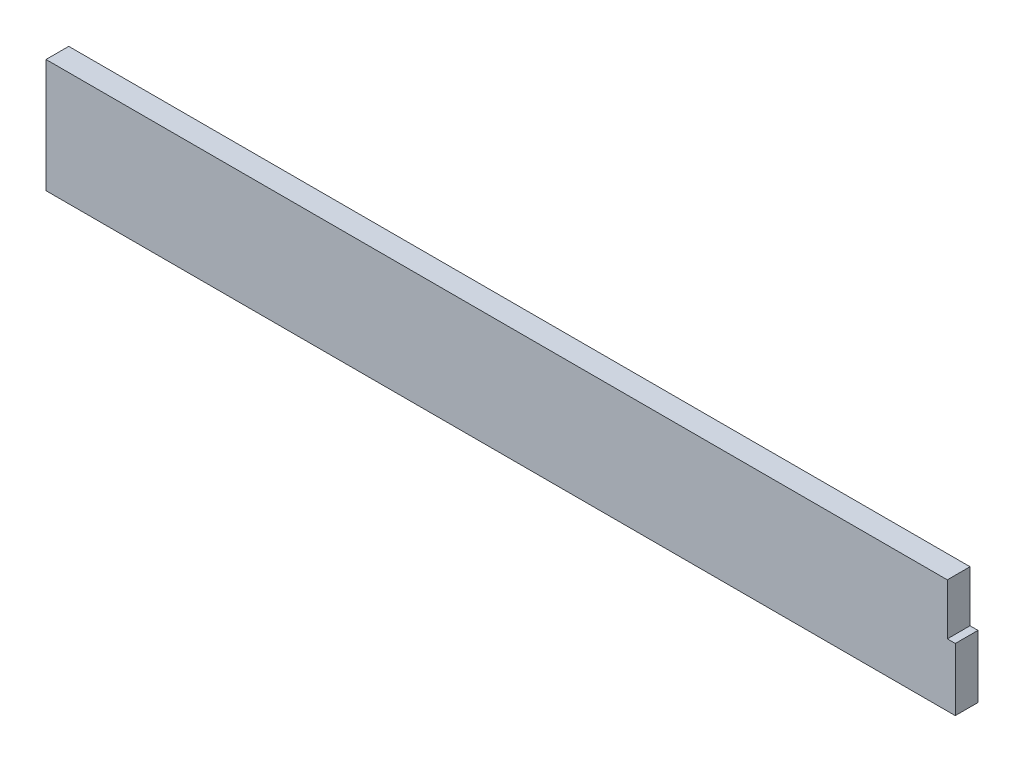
ISO-10303-21;
HEADER;
FILE_DESCRIPTION(('STEP AP214'),'2;1');
FILE_NAME('part.step','',(''),(''),'','','');
FILE_SCHEMA(('AUTOMOTIVE_DESIGN { 1 0 10303 214 1 1 1 1 }'));
ENDSEC;
DATA;
#1=APPLICATION_CONTEXT('core data for automotive mechanical design processes');
#2=APPLICATION_PROTOCOL_DEFINITION('international standard','automotive_design',2000,#1);
#3=PRODUCT_CONTEXT('',#1,'mechanical');
#4=PRODUCT('Part','Part','',(#3));
#5=PRODUCT_RELATED_PRODUCT_CATEGORY('part','',(#4));
#6=PRODUCT_DEFINITION_FORMATION('','',#4);
#7=PRODUCT_DEFINITION_CONTEXT('part definition',#1,'design');
#8=PRODUCT_DEFINITION('design','',#6,#7);
#9=PRODUCT_DEFINITION_SHAPE('','',#8);
#10=(LENGTH_UNIT() NAMED_UNIT(*) SI_UNIT(.MILLI.,.METRE.));
#11=(NAMED_UNIT(*) PLANE_ANGLE_UNIT() SI_UNIT($,.RADIAN.));
#12=(NAMED_UNIT(*) SI_UNIT($,.STERADIAN.) SOLID_ANGLE_UNIT());
#13=UNCERTAINTY_MEASURE_WITH_UNIT(LENGTH_MEASURE(1.E-05),#10,'distance_accuracy_value','');
#14=(GEOMETRIC_REPRESENTATION_CONTEXT(3) GLOBAL_UNCERTAINTY_ASSIGNED_CONTEXT((#13)) GLOBAL_UNIT_ASSIGNED_CONTEXT((#10,
#11,#12)) REPRESENTATION_CONTEXT('',''));
#15=CARTESIAN_POINT('',(0.,0.,0.));
#16=DIRECTION('',(0.,0.,1.));
#17=DIRECTION('',(1.,0.,0.));
#18=AXIS2_PLACEMENT_3D('',#15,#16,#17);
#19=CARTESIAN_POINT('',(0.,0.,2.));
#20=DIRECTION('',(1.,0.,0.));
#21=DIRECTION('',(0.,0.,-1.));
#22=AXIS2_PLACEMENT_3D('',#19,#20,#21);
#23=PLANE('',#22);
#24=DIRECTION('',(0.,-1.,0.));
#25=VECTOR('',#24,1.);
#26=CARTESIAN_POINT('',(0.,0.,0.));
#27=LINE('',#26,#25);
#28=CARTESIAN_POINT('',(0.,10.,0.));
#29=VERTEX_POINT('',#28);
#30=CARTESIAN_POINT('',(0.,0.,0.));
#31=VERTEX_POINT('',#30);
#32=EDGE_CURVE('E116',#29,#31,#27,.T.);
#33=ORIENTED_EDGE('',*,*,#32,.T.);
#34=DIRECTION('',(0.,0.,-1.));
#35=VECTOR('',#34,1.);
#36=CARTESIAN_POINT('',(0.,0.,2.));
#37=LINE('',#36,#35);
#38=CARTESIAN_POINT('',(0.,0.,2.));
#39=VERTEX_POINT('',#38);
#40=EDGE_CURVE('E11',#39,#31,#37,.T.);
#41=ORIENTED_EDGE('',*,*,#40,.F.);
#42=DIRECTION('',(0.,-1.,0.));
#43=VECTOR('',#42,1.);
#44=CARTESIAN_POINT('',(0.,0.,2.));
#45=LINE('',#44,#43);
#46=CARTESIAN_POINT('',(0.,10.,2.));
#47=VERTEX_POINT('',#46);
#48=EDGE_CURVE('E126',#47,#39,#45,.T.);
#49=ORIENTED_EDGE('',*,*,#48,.F.);
#50=DIRECTION('',(0.,0.,-1.));
#51=VECTOR('',#50,1.);
#52=CARTESIAN_POINT('',(0.,10.,2.));
#53=LINE('',#52,#51);
#54=EDGE_CURVE('E112',#47,#29,#53,.T.);
#55=ORIENTED_EDGE('',*,*,#54,.T.);
#56=EDGE_LOOP('',(#33,#41,#49,#55));
#57=FACE_BOUND('',#56,.T.);
#58=ADVANCED_FACE('F32',(#57),#23,.F.);
#59=CARTESIAN_POINT('',(0.,0.,2.));
#60=DIRECTION('',(0.,1.,0.));
#61=DIRECTION('',(0.,0.,1.));
#62=AXIS2_PLACEMENT_3D('',#59,#60,#61);
#63=PLANE('',#62);
#64=DIRECTION('',(1.,0.,0.));
#65=VECTOR('',#64,1.);
#66=CARTESIAN_POINT('',(0.,0.,0.));
#67=LINE('',#66,#65);
#68=CARTESIAN_POINT('',(80.,0.,0.));
#69=VERTEX_POINT('',#68);
#70=EDGE_CURVE('E119',#31,#69,#67,.T.);
#71=ORIENTED_EDGE('',*,*,#70,.T.);
#72=DIRECTION('',(0.,0.,-1.));
#73=VECTOR('',#72,1.);
#74=CARTESIAN_POINT('',(80.,0.,2.));
#75=LINE('',#74,#73);
#76=CARTESIAN_POINT('',(80.,0.,2.));
#77=VERTEX_POINT('',#76);
#78=EDGE_CURVE('E40',#77,#69,#75,.T.);
#79=ORIENTED_EDGE('',*,*,#78,.F.);
#80=DIRECTION('',(1.,0.,0.));
#81=VECTOR('',#80,1.);
#82=CARTESIAN_POINT('',(0.,0.,2.));
#83=LINE('',#82,#81);
#84=EDGE_CURVE('E85',#39,#77,#83,.T.);
#85=ORIENTED_EDGE('',*,*,#84,.F.);
#86=ORIENTED_EDGE('',*,*,#40,.T.);
#87=EDGE_LOOP('',(#71,#79,#85,#86));
#88=FACE_BOUND('',#87,.T.);
#89=ADVANCED_FACE('F150',(#88),#63,.F.);
#90=CARTESIAN_POINT('',(80.,0.,2.));
#91=DIRECTION('',(-1.,0.,0.));
#92=DIRECTION('',(0.,0.,1.));
#93=AXIS2_PLACEMENT_3D('',#90,#91,#92);
#94=PLANE('',#93);
#95=DIRECTION('',(0.,1.,0.));
#96=VECTOR('',#95,1.);
#97=CARTESIAN_POINT('',(80.,0.,0.));
#98=LINE('',#97,#96);
#99=CARTESIAN_POINT('',(80.,5.5,0.));
#100=VERTEX_POINT('',#99);
#101=EDGE_CURVE('E121',#69,#100,#98,.T.);
#102=ORIENTED_EDGE('',*,*,#101,.T.);
#103=DIRECTION('',(0.,0.,-1.));
#104=VECTOR('',#103,1.);
#105=CARTESIAN_POINT('',(80.,5.5,2.));
#106=LINE('',#105,#104);
#107=CARTESIAN_POINT('',(80.,5.5,2.));
#108=VERTEX_POINT('',#107);
#109=EDGE_CURVE('E107',#108,#100,#106,.T.);
#110=ORIENTED_EDGE('',*,*,#109,.F.);
#111=DIRECTION('',(0.,1.,0.));
#112=VECTOR('',#111,1.);
#113=CARTESIAN_POINT('',(80.,0.,2.));
#114=LINE('',#113,#112);
#115=EDGE_CURVE('E98',#77,#108,#114,.T.);
#116=ORIENTED_EDGE('',*,*,#115,.F.);
#117=ORIENTED_EDGE('',*,*,#78,.T.);
#118=EDGE_LOOP('',(#102,#110,#116,#117));
#119=FACE_BOUND('',#118,.T.);
#120=ADVANCED_FACE('F132',(#119),#94,.F.);
#121=CARTESIAN_POINT('',(79.3000000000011,5.5,2.));
#122=DIRECTION('',(0.,-1.,0.));
#123=DIRECTION('',(0.,0.,-1.));
#124=AXIS2_PLACEMENT_3D('',#121,#122,#123);
#125=PLANE('',#124);
#126=DIRECTION('',(-1.,0.,0.));
#127=VECTOR('',#126,1.);
#128=CARTESIAN_POINT('',(79.3000000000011,5.5,0.));
#129=LINE('',#128,#127);
#130=CARTESIAN_POINT('',(79.3000000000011,5.5,0.));
#131=VERTEX_POINT('',#130);
#132=EDGE_CURVE('E106',#100,#131,#129,.T.);
#133=ORIENTED_EDGE('',*,*,#132,.T.);
#134=DIRECTION('',(0.,0.,-1.));
#135=VECTOR('',#134,1.);
#136=CARTESIAN_POINT('',(79.3000000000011,5.5,2.));
#137=LINE('',#136,#135);
#138=CARTESIAN_POINT('',(79.3000000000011,5.5,2.));
#139=VERTEX_POINT('',#138);
#140=EDGE_CURVE('E103',#139,#131,#137,.T.);
#141=ORIENTED_EDGE('',*,*,#140,.F.);
#142=DIRECTION('',(-1.,0.,0.));
#143=VECTOR('',#142,1.);
#144=CARTESIAN_POINT('',(79.3000000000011,5.5,2.));
#145=LINE('',#144,#143);
#146=EDGE_CURVE('E92',#108,#139,#145,.T.);
#147=ORIENTED_EDGE('',*,*,#146,.F.);
#148=ORIENTED_EDGE('',*,*,#109,.T.);
#149=EDGE_LOOP('',(#133,#141,#147,#148));
#150=FACE_BOUND('',#149,.T.);
#151=ADVANCED_FACE('F104',(#150),#125,.F.);
#152=CARTESIAN_POINT('',(79.3000000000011,5.5,2.));
#153=DIRECTION('',(-1.,0.,0.));
#154=DIRECTION('',(0.,0.,1.));
#155=AXIS2_PLACEMENT_3D('',#152,#153,#154);
#156=PLANE('',#155);
#157=DIRECTION('',(0.,1.,0.));
#158=VECTOR('',#157,1.);
#159=CARTESIAN_POINT('',(79.3000000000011,5.5,0.));
#160=LINE('',#159,#158);
#161=CARTESIAN_POINT('',(79.3000000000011,10.,0.));
#162=VERTEX_POINT('',#161);
#163=EDGE_CURVE('E71',#131,#162,#160,.T.);
#164=ORIENTED_EDGE('',*,*,#163,.T.);
#165=DIRECTION('',(0.,0.,-1.));
#166=VECTOR('',#165,1.);
#167=CARTESIAN_POINT('',(79.3000000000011,10.,2.));
#168=LINE('',#167,#166);
#169=CARTESIAN_POINT('',(79.3000000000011,10.,2.));
#170=VERTEX_POINT('',#169);
#171=EDGE_CURVE('E108',#170,#162,#168,.T.);
#172=ORIENTED_EDGE('',*,*,#171,.F.);
#173=DIRECTION('',(0.,1.,0.));
#174=VECTOR('',#173,1.);
#175=CARTESIAN_POINT('',(79.3000000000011,5.5,2.));
#176=LINE('',#175,#174);
#177=EDGE_CURVE('E96',#139,#170,#176,.T.);
#178=ORIENTED_EDGE('',*,*,#177,.F.);
#179=ORIENTED_EDGE('',*,*,#140,.T.);
#180=EDGE_LOOP('',(#164,#172,#178,#179));
#181=FACE_BOUND('',#180,.T.);
#182=ADVANCED_FACE('F110',(#181),#156,.F.);
#183=CARTESIAN_POINT('',(0.,10.,2.));
#184=DIRECTION('',(0.,-1.,0.));
#185=DIRECTION('',(0.,0.,-1.));
#186=AXIS2_PLACEMENT_3D('',#183,#184,#185);
#187=PLANE('',#186);
#188=DIRECTION('',(-1.,0.,0.));
#189=VECTOR('',#188,1.);
#190=CARTESIAN_POINT('',(0.,10.,0.));
#191=LINE('',#190,#189);
#192=EDGE_CURVE('E77',#162,#29,#191,.T.);
#193=ORIENTED_EDGE('',*,*,#192,.T.);
#194=ORIENTED_EDGE('',*,*,#54,.F.);
#195=DIRECTION('',(-1.,0.,0.));
#196=VECTOR('',#195,1.);
#197=CARTESIAN_POINT('',(0.,10.,2.));
#198=LINE('',#197,#196);
#199=EDGE_CURVE('E48',#170,#47,#198,.T.);
#200=ORIENTED_EDGE('',*,*,#199,.F.);
#201=ORIENTED_EDGE('',*,*,#171,.T.);
#202=EDGE_LOOP('',(#193,#194,#200,#201));
#203=FACE_BOUND('',#202,.T.);
#204=ADVANCED_FACE('F139',(#203),#187,.F.);
#205=CARTESIAN_POINT('',(0.,10.,2.));
#206=DIRECTION('',(0.,0.,-1.));
#207=DIRECTION('',(-1.,0.,0.));
#208=AXIS2_PLACEMENT_3D('',#205,#206,#207);
#209=PLANE('',#208);
#210=ORIENTED_EDGE('',*,*,#48,.T.);
#211=ORIENTED_EDGE('',*,*,#84,.T.);
#212=ORIENTED_EDGE('',*,*,#115,.T.);
#213=ORIENTED_EDGE('',*,*,#146,.T.);
#214=ORIENTED_EDGE('',*,*,#177,.T.);
#215=ORIENTED_EDGE('',*,*,#199,.T.);
#216=EDGE_LOOP('',(#210,#211,#212,#213,#214,#215));
#217=FACE_BOUND('',#216,.T.);
#218=ADVANCED_FACE('F94',(#217),#209,.F.);
#219=CARTESIAN_POINT('',(0.,10.,0.));
#220=DIRECTION('',(0.,0.,-1.));
#221=DIRECTION('',(-1.,0.,0.));
#222=AXIS2_PLACEMENT_3D('',#219,#220,#221);
#223=PLANE('',#222);
#224=ORIENTED_EDGE('',*,*,#32,.F.);
#225=ORIENTED_EDGE('',*,*,#192,.F.);
#226=ORIENTED_EDGE('',*,*,#163,.F.);
#227=ORIENTED_EDGE('',*,*,#132,.F.);
#228=ORIENTED_EDGE('',*,*,#101,.F.);
#229=ORIENTED_EDGE('',*,*,#70,.F.);
#230=EDGE_LOOP('',(#224,#225,#226,#227,#228,#229));
#231=FACE_BOUND('',#230,.T.);
#232=ADVANCED_FACE('F135',(#231),#223,.T.);
#233=CLOSED_SHELL('',(#58,#89,#120,#151,#182,#204,#218,#232));
#234=MANIFOLD_SOLID_BREP('B2',#233);
#235=ADVANCED_BREP_SHAPE_REPRESENTATION('',(#18,#234),#14);
#236=SHAPE_DEFINITION_REPRESENTATION(#9,#235);
ENDSEC;
END-ISO-10303-21;
